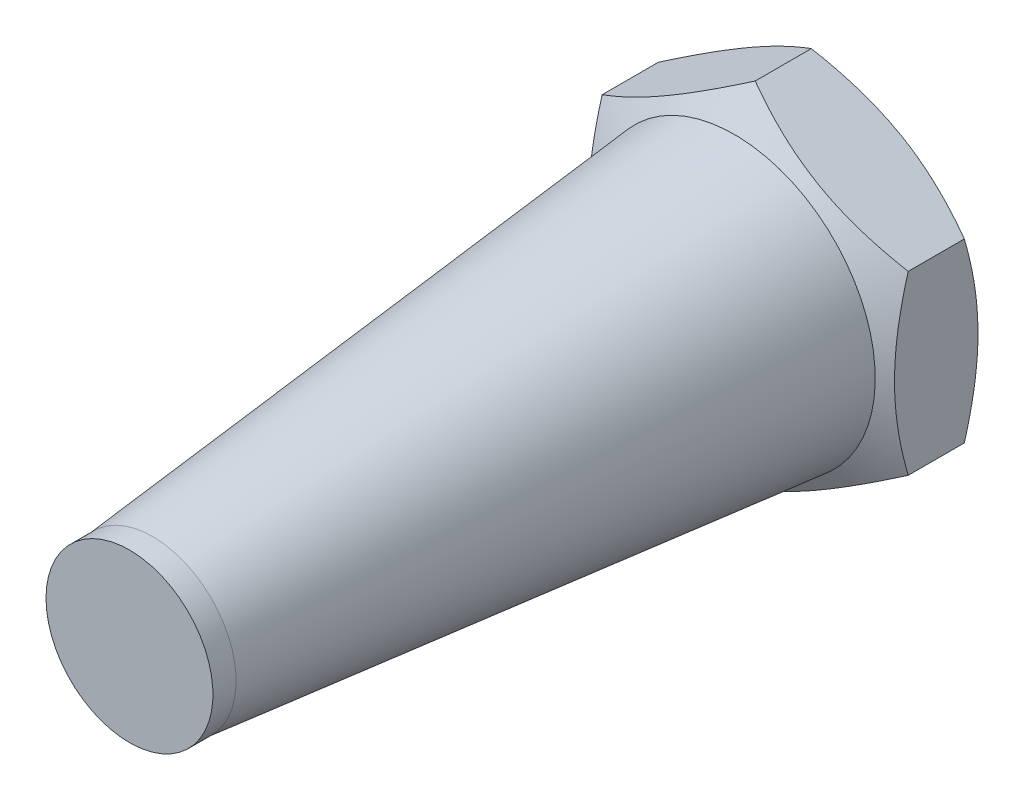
ISO-10303-21;
HEADER;
FILE_DESCRIPTION(('STEP AP214'),'2;1');
FILE_NAME('part.step','',(''),(''),'','','');
FILE_SCHEMA(('AUTOMOTIVE_DESIGN { 1 0 10303 214 1 1 1 1 }'));
ENDSEC;
DATA;
#1=APPLICATION_CONTEXT('core data for automotive mechanical design processes');
#2=APPLICATION_PROTOCOL_DEFINITION('international standard','automotive_design',2000,#1);
#3=PRODUCT_CONTEXT('',#1,'mechanical');
#4=PRODUCT('Part','Part','',(#3));
#5=PRODUCT_RELATED_PRODUCT_CATEGORY('part','',(#4));
#6=PRODUCT_DEFINITION_FORMATION('','',#4);
#7=PRODUCT_DEFINITION_CONTEXT('part definition',#1,'design');
#8=PRODUCT_DEFINITION('design','',#6,#7);
#9=PRODUCT_DEFINITION_SHAPE('','',#8);
#10=(LENGTH_UNIT() NAMED_UNIT(*) SI_UNIT(.MILLI.,.METRE.));
#11=(NAMED_UNIT(*) PLANE_ANGLE_UNIT() SI_UNIT($,.RADIAN.));
#12=(NAMED_UNIT(*) SI_UNIT($,.STERADIAN.) SOLID_ANGLE_UNIT());
#13=UNCERTAINTY_MEASURE_WITH_UNIT(LENGTH_MEASURE(1.E-05),#10,'distance_accuracy_value','');
#14=(GEOMETRIC_REPRESENTATION_CONTEXT(3) GLOBAL_UNCERTAINTY_ASSIGNED_CONTEXT((#13)) GLOBAL_UNIT_ASSIGNED_CONTEXT((#10,
#11,#12)) REPRESENTATION_CONTEXT('',''));
#15=CARTESIAN_POINT('',(0.,0.,0.));
#16=DIRECTION('',(0.,0.,1.));
#17=DIRECTION('',(1.,0.,0.));
#18=AXIS2_PLACEMENT_3D('',#15,#16,#17);
#19=CARTESIAN_POINT('',(0.,0.,1.5));
#20=DIRECTION('',(0.,0.,-1.));
#21=DIRECTION('',(0.500000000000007,0.866025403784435,0.));
#22=AXIS2_PLACEMENT_3D('',#19,#20,#21);
#23=CONICAL_SURFACE('',#22,8.0980762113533,1.0471975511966);
#24=CARTESIAN_POINT('',(0.,0.,3.2540341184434));
#25=DIRECTION('',(0.,0.,-1.));
#26=DIRECTION('',(0.500000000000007,0.866025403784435,0.));
#27=AXIS2_PLACEMENT_3D('',#24,#25,#26);
#28=CIRCLE('',#27,5.06);
#29=CARTESIAN_POINT('',(2.53000000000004,4.38208854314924,3.2540341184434));
#30=VERTEX_POINT('',#29);
#31=EDGE_CURVE('E280',#30,#30,#28,.T.);
#32=ORIENTED_EDGE('',*,*,#31,.T.);
#33=EDGE_LOOP('',(#32));
#34=FACE_BOUND('',#33,.T.);
#35=CARTESIAN_POINT('',(-4.63445341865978,9.02655588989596,0.317188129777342));
#36=CARTESIAN_POINT('',(-4.42642850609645,8.90645265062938,0.433698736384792));
#37=CARTESIAN_POINT('',(-4.21792578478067,8.78607354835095,0.549091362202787));
#38=CARTESIAN_POINT('',(-3.79971060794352,8.54461690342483,0.777011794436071));
#39=CARTESIAN_POINT('',(-3.58999796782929,8.42353925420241,0.889539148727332));
#40=CARTESIAN_POINT('',(-3.16802728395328,8.17991436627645,1.11166683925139));
#41=CARTESIAN_POINT('',(-2.95576159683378,8.05736271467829,1.22124788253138));
#42=CARTESIAN_POINT('',(-2.52954101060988,7.81128414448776,1.43592160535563));
#43=CARTESIAN_POINT('',(-2.31558619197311,7.6877572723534,1.54101449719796));
#44=CARTESIAN_POINT('',(-1.87876523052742,7.43555857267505,1.74880037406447));
#45=CARTESIAN_POINT('',(-1.6558329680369,7.3068485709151,1.85130903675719));
#46=CARTESIAN_POINT('',(-1.20735940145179,7.04792223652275,2.04856142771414));
#47=CARTESIAN_POINT('',(-0.981817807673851,6.9177057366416,2.14330428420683));
#48=CARTESIAN_POINT('',(-0.528189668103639,6.65580340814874,2.32253603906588));
#49=CARTESIAN_POINT('',(-0.300109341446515,6.52412117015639,2.40704571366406));
#50=CARTESIAN_POINT('',(0.159322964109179,6.25886780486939,2.56309752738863));
#51=CARTESIAN_POINT('',(0.390673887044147,6.12529728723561,2.63464375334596));
#52=CARTESIAN_POINT('',(0.855502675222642,5.85692826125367,2.76095502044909));
#53=CARTESIAN_POINT('',(1.08896178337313,5.72214058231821,2.81581040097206));
#54=CARTESIAN_POINT('',(1.55878077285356,5.45089046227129,2.90563425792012));
#55=CARTESIAN_POINT('',(1.79514037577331,5.31442818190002,2.94060462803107));
#56=CARTESIAN_POINT('',(2.26649270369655,5.04229278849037,2.98741101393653));
#57=CARTESIAN_POINT('',(2.50146273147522,4.90663277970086,2.99954428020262));
#58=CARTESIAN_POINT('',(2.97145539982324,4.63528238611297,3.00043005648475));
#59=CARTESIAN_POINT('',(3.20647804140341,4.49959200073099,2.9891820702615));
#60=CARTESIAN_POINT('',(3.60553078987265,4.26919878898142,2.95102792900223));
#61=CARTESIAN_POINT('',(3.76998818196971,4.17424926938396,2.92974037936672));
#62=CARTESIAN_POINT('',(4.09769047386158,3.98505026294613,2.87704309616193));
#63=CARTESIAN_POINT('',(4.26093520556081,3.89080087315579,2.84563198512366));
#64=CARTESIAN_POINT('',(4.74863690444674,3.60922616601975,2.73786529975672));
#65=CARTESIAN_POINT('',(5.07087880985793,3.42317971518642,2.64799613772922));
#66=CARTESIAN_POINT('',(5.55274402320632,3.1449747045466,2.49227965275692));
#67=CARTESIAN_POINT('',(5.71486728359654,3.05137279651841,2.43616090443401));
#68=CARTESIAN_POINT('',(6.03753849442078,2.86507848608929,2.31812622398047));
#69=CARTESIAN_POINT('',(6.19808643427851,2.77238608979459,2.25621025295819));
#70=CARTESIAN_POINT('',(6.51765874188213,2.58788093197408,2.12757219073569));
#71=CARTESIAN_POINT('',(6.67668359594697,2.49606788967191,2.06085169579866));
#72=CARTESIAN_POINT('',(6.99341719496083,2.31320166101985,1.92338647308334));
#73=CARTESIAN_POINT('',(7.15112595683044,2.22214846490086,1.85264179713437));
#74=CARTESIAN_POINT('',(7.52950150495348,2.00369324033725,1.67824012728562));
#75=CARTESIAN_POINT('',(7.74959700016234,1.87662104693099,1.57293336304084));
#76=CARTESIAN_POINT('',(8.18787356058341,1.62358195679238,1.35712011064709));
#77=CARTESIAN_POINT('',(8.40605449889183,1.49761513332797,1.24661328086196));
#78=CARTESIAN_POINT('',(8.84086446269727,1.24657748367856,1.02146878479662));
#79=CARTESIAN_POINT('',(9.05749314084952,1.12150685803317,0.906830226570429));
#80=CARTESIAN_POINT('',(9.48942656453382,0.87212997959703,0.674268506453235));
#81=CARTESIAN_POINT('',(9.70473128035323,0.747823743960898,0.556345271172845));
#82=CARTESIAN_POINT('',(10.1344754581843,0.499710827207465,0.317712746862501));
#83=CARTESIAN_POINT('',(10.3489136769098,0.375904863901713,0.197000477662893));
#84=CARTESIAN_POINT('',(10.7768618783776,0.128828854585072,-0.0466003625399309));
#85=CARTESIAN_POINT('',(10.9903718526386,0.00555881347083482,-0.169488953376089));
#86=CARTESIAN_POINT('',(11.6296754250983,-0.363543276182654,-0.540793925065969));
#87=CARTESIAN_POINT('',(12.0543041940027,-0.608702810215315,-0.791883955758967));
#88=CARTESIAN_POINT('',(12.8646905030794,-1.07657956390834,-1.27711141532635));
#89=CARTESIAN_POINT('',(13.250633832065,-1.29940404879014,-1.51083699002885));
#90=CARTESIAN_POINT('',(14.0211073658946,-1.74423715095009,-1.98141180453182));
#91=CARTESIAN_POINT('',(14.4056375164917,-1.96624573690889,-2.21826116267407));
#92=CARTESIAN_POINT('',(15.1726058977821,-2.40905513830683,-2.69371435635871));
#93=CARTESIAN_POINT('',(15.5550469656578,-2.62985759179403,-2.93231209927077));
#94=CARTESIAN_POINT('',(16.3190296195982,-3.07094318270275,-3.41136076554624));
#95=CARTESIAN_POINT('',(16.7005712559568,-3.29122634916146,-3.65181158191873));
#96=CARTESIAN_POINT('',(17.0817838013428,-3.51131951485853,-3.89295145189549));
#97=B_SPLINE_CURVE_WITH_KNOTS('',3,(#35,#36,#37,#38,#39,#40,#41,#42,#43,#44,#45,#46,#47,#48,#49,
#50,#51,#52,#53,#54,#55,#56,#57,#58,#59,#60,#61,#62,#63,#64,#65,#66,#67,#68,#69,#70,#71,#72,#73,
#74,#75,#76,#77,#78,#79,#80,#81,#82,#83,#84,#85,#86,#87,#88,#89,#90,#91,#92,#93,#94,#95,#96),
.UNSPECIFIED.,.F.,.F.,(4,2,2,2,2,2,2,2,2,2,2,2,2,2,2,2,2,2,2,2,2,2,2,2,2,2,2,2,2,2,4),(0.,
0.800924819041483,1.60197524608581,2.40739108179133,3.21276877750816,4.04391063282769,
4.87514566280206,5.70466370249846,6.53391977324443,7.35860419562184,8.18321006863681,
8.99700649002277,9.81082018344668,10.3838076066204,10.9568730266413,12.1036361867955,
12.6898898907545,13.2761475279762,13.8622112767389,14.4482674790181,15.2734821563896,
16.0987511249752,16.924199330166,17.7496659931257,18.5760597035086,19.4024609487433,
21.0550266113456,22.5646743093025,24.0743793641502,25.5801946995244,27.0859237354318),.UNSPECIFIED.);
#98=CARTESIAN_POINT('',(5.5,3.17542648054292,2.50875981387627));
#99=VERTEX_POINT('',#98);
#100=CARTESIAN_POINT('',(0.,6.35085296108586,2.50875981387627));
#101=VERTEX_POINT('',#100);
#102=EDGE_CURVE('E102',#99,#101,#97,.F.);
#103=ORIENTED_EDGE('',*,*,#102,.T.);
#104=CARTESIAN_POINT('',(0.000200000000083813,6.3509684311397,2.50869314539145));
#105=CARTESIAN_POINT('',(-0.12069657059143,6.28116876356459,2.54898642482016));
#106=CARTESIAN_POINT('',(-0.242043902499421,6.21110884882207,2.58745108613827));
#107=CARTESIAN_POINT('',(-0.485724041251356,6.07042005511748,2.6602195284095));
#108=CARTESIAN_POINT('',(-0.608057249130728,5.99979094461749,2.6945215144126));
#109=CARTESIAN_POINT('',(-0.977015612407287,5.78677273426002,2.79051018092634));
#110=CARTESIAN_POINT('',(-1.22509718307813,5.64354277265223,2.84510769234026));
#111=CARTESIAN_POINT('',(-1.59634674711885,5.42920173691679,2.90913016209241));
#112=CARTESIAN_POINT('',(-1.71840546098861,5.35873110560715,2.92736840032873));
#113=CARTESIAN_POINT('',(-1.96307442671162,5.21747141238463,2.95795148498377));
#114=CARTESIAN_POINT('',(-2.08568462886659,5.14668237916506,2.97029685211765));
#115=CARTESIAN_POINT('',(-2.33111799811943,5.00498135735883,2.98877956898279));
#116=CARTESIAN_POINT('',(-2.45394076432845,4.93406960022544,2.99492396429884));
#117=CARTESIAN_POINT('',(-2.69969299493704,4.79218448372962,3.00087957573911));
#118=CARTESIAN_POINT('',(-2.82262245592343,4.7212111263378,3.00069098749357));
#119=CARTESIAN_POINT('',(-3.159414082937,4.52676438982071,2.99146908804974));
#120=CARTESIAN_POINT('',(-3.37316601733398,4.40335465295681,2.97598603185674));
#121=CARTESIAN_POINT('',(-3.79925015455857,4.15735486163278,2.92688789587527));
#122=CARTESIAN_POINT('',(-4.01158085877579,4.03476567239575,2.89325603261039));
#123=CARTESIAN_POINT('',(-4.43852257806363,3.78827075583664,2.80918564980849));
#124=CARTESIAN_POINT('',(-4.65307971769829,3.66439613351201,2.75839091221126));
#125=CARTESIAN_POINT('',(-5.0789942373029,3.41849427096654,2.64310716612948));
#126=CARTESIAN_POINT('',(-5.29035707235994,3.29646388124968,2.57864523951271));
#127=CARTESIAN_POINT('',(-5.5002,3.17531101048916,2.50869314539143));
#128=B_SPLINE_CURVE_WITH_KNOTS('',3,(#104,#105,#106,#107,#108,#109,#110,#111,#112,#113,#114,
#115,#116,#117,#118,#119,#120,#121,#122,#123,#124,#125,#126,#127),.UNSPECIFIED.,.F.,.F.,(4,2,2,
2,2,2,2,2,2,2,2,4),(0.,0.435859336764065,0.871905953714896,1.74581116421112,2.17206086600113,
2.59827289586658,3.02400011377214,3.44971418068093,4.19085033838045,4.93267305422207,
5.6909489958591,6.44773620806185),.UNSPECIFIED.);
#129=CARTESIAN_POINT('',(-5.5,3.175426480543,2.50875981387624));
#130=VERTEX_POINT('',#129);
#131=EDGE_CURVE('E93',#101,#130,#128,.T.);
#132=ORIENTED_EDGE('',*,*,#131,.T.);
#133=CARTESIAN_POINT('',(-5.5,3.17565742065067,2.50869314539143));
#134=CARTESIAN_POINT('',(-5.5,3.03605808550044,2.54898642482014));
#135=CARTESIAN_POINT('',(-5.5,2.8959382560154,2.58745108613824));
#136=CARTESIAN_POINT('',(-5.5,2.61456066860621,2.66021952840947));
#137=CARTESIAN_POINT('',(-5.5,2.47330244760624,2.69452151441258));
#138=CARTESIAN_POINT('',(-5.5,2.04726602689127,2.79051018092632));
#139=CARTESIAN_POINT('',(-5.5,1.76080610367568,2.84510769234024));
#140=CARTESIAN_POINT('',(-5.5,1.3321240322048,2.90913016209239));
#141=CARTESIAN_POINT('',(-5.5,1.19118276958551,2.92736840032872));
#142=CARTESIAN_POINT('',(-5.5,0.908663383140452,2.95795148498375));
#143=CARTESIAN_POINT('',(-5.5,0.767085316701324,2.97029685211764));
#144=CARTESIAN_POINT('',(-5.5,0.483683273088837,2.98877956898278));
#145=CARTESIAN_POINT('',(-5.5,0.341859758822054,2.99492396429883));
#146=CARTESIAN_POINT('',(-5.5,0.0580895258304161,3.0008795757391));
#147=CARTESIAN_POINT('',(-5.5,-0.083857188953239,3.00069098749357));
#148=CARTESIAN_POINT('',(-5.5,-0.472750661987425,2.99146908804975));
#149=CARTESIAN_POINT('',(-5.5,-0.719570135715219,2.97598603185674));
#150=CARTESIAN_POINT('',(-5.5,-1.21156971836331,2.92688789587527));
#151=CARTESIAN_POINT('',(-5.5,-1.45674809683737,2.8932560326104));
#152=CARTESIAN_POINT('',(-5.5,-1.9497379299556,2.80918564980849));
#153=CARTESIAN_POINT('',(-5.5,-2.19748717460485,2.75839091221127));
#154=CARTESIAN_POINT('',(-5.5,-2.68929089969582,2.6431071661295));
#155=CARTESIAN_POINT('',(-5.5,-2.93335167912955,2.57864523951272));
#156=CARTESIAN_POINT('',(-5.5,-3.1756574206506,2.50869314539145));
#157=B_SPLINE_CURVE_WITH_KNOTS('',3,(#133,#134,#135,#136,#137,#138,#139,#140,#141,#142,#143,
#144,#145,#146,#147,#148,#149,#150,#151,#152,#153,#154,#155,#156),.UNSPECIFIED.,.F.,.F.,(4,2,2,
2,2,2,2,2,2,2,2,4),(0.,0.435859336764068,0.871905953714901,1.74581116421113,2.17206086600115,
2.5982728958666,3.02400011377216,3.44971418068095,4.19085033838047,4.93267305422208,
5.69094899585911,6.44773620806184),.UNSPECIFIED.);
#158=CARTESIAN_POINT('',(-5.5,-3.17542648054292,2.50875981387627));
#159=VERTEX_POINT('',#158);
#160=EDGE_CURVE('E82',#130,#159,#157,.T.);
#161=ORIENTED_EDGE('',*,*,#160,.T.);
#162=CARTESIAN_POINT('',(-10.1344534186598,-0.499723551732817,0.317188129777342));
#163=CARTESIAN_POINT('',(-9.92642850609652,-0.61982679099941,0.433698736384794));
#164=CARTESIAN_POINT('',(-9.71792578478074,-0.74020589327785,0.54909136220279));
#165=CARTESIAN_POINT('',(-9.2997106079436,-0.981662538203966,0.777011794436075));
#166=CARTESIAN_POINT('',(-9.08999796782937,-1.10274018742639,0.889539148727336));
#167=CARTESIAN_POINT('',(-8.66802728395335,-1.34636507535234,1.11166683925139));
#168=CARTESIAN_POINT('',(-8.45576159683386,-1.4689167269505,1.22124788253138));
#169=CARTESIAN_POINT('',(-8.02954101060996,-1.71499529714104,1.43592160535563));
#170=CARTESIAN_POINT('',(-7.81558619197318,-1.8385221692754,1.54101449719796));
#171=CARTESIAN_POINT('',(-7.37876523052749,-2.09072086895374,1.74880037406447));
#172=CARTESIAN_POINT('',(-7.15583296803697,-2.2194308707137,1.85130903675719));
#173=CARTESIAN_POINT('',(-6.70735940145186,-2.47835720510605,2.04856142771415));
#174=CARTESIAN_POINT('',(-6.48181780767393,-2.6085737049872,2.14330428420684));
#175=CARTESIAN_POINT('',(-6.02818966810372,-2.87047603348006,2.32253603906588));
#176=CARTESIAN_POINT('',(-5.80010934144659,-3.00215827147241,2.40704571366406));
#177=CARTESIAN_POINT('',(-5.3406770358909,-3.2674116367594,2.56309752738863));
#178=CARTESIAN_POINT('',(-5.10932611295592,-3.40098215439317,2.63464375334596));
#179=CARTESIAN_POINT('',(-4.64449732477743,-3.66935118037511,2.76095502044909));
#180=CARTESIAN_POINT('',(-4.41103821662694,-3.80413885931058,2.81581040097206));
#181=CARTESIAN_POINT('',(-3.94121922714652,-4.07538897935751,2.90563425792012));
#182=CARTESIAN_POINT('',(-3.70485962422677,-4.21185125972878,2.94060462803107));
#183=CARTESIAN_POINT('',(-3.23350729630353,-4.48398665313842,2.98741101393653));
#184=CARTESIAN_POINT('',(-2.99853726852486,-4.61964666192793,2.99954428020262));
#185=CARTESIAN_POINT('',(-2.52854460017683,-4.89099705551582,3.00043005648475));
#186=CARTESIAN_POINT('',(-2.29352195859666,-5.02668744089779,2.9891820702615));
#187=CARTESIAN_POINT('',(-1.89446921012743,-5.25708065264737,2.95102792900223));
#188=CARTESIAN_POINT('',(-1.73001181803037,-5.35203017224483,2.92974037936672));
#189=CARTESIAN_POINT('',(-1.40230952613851,-5.54122917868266,2.87704309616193));
#190=CARTESIAN_POINT('',(-1.23906479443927,-5.635478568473,2.84563198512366));
#191=CARTESIAN_POINT('',(-0.751363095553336,-5.91705327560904,2.73786529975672));
#192=CARTESIAN_POINT('',(-0.429121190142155,-6.10309972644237,2.64799613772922));
#193=CARTESIAN_POINT('',(0.0527440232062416,-6.38130473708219,2.49227965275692));
#194=CARTESIAN_POINT('',(0.214867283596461,-6.47490664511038,2.43616090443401));
#195=CARTESIAN_POINT('',(0.537538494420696,-6.6612009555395,2.31812622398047));
#196=CARTESIAN_POINT('',(0.698086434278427,-6.7538933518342,2.25621025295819));
#197=CARTESIAN_POINT('',(1.01765874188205,-6.93839850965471,2.12757219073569));
#198=CARTESIAN_POINT('',(1.17668359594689,-7.03021155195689,2.06085169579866));
#199=CARTESIAN_POINT('',(1.49341719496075,-7.21307778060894,1.92338647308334));
#200=CARTESIAN_POINT('',(1.65112595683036,-7.30413097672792,1.85264179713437));
#201=CARTESIAN_POINT('',(2.0295015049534,-7.52258620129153,1.67824012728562));
#202=CARTESIAN_POINT('',(2.24959700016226,-7.64965839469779,1.57293336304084));
#203=CARTESIAN_POINT('',(2.68787356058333,-7.90269748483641,1.35712011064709));
#204=CARTESIAN_POINT('',(2.90605449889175,-8.02866430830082,1.24661328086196));
#205=CARTESIAN_POINT('',(3.34086446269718,-8.27970195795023,1.02146878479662));
#206=CARTESIAN_POINT('',(3.55749314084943,-8.40477258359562,0.906830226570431));
#207=CARTESIAN_POINT('',(3.98942656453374,-8.65414946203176,0.674268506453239));
#208=CARTESIAN_POINT('',(4.20473128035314,-8.77845569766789,0.556345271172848));
#209=CARTESIAN_POINT('',(4.63447545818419,-9.02656861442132,0.317712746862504));
#210=CARTESIAN_POINT('',(4.84891367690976,-9.15037457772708,0.197000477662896));
#211=CARTESIAN_POINT('',(5.27686187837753,-9.39745058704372,-0.0466003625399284));
#212=CARTESIAN_POINT('',(5.49037185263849,-9.52072062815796,-0.169488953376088));
#213=CARTESIAN_POINT('',(6.12967542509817,-9.88982271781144,-0.540793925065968));
#214=CARTESIAN_POINT('',(6.55430419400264,-10.1349822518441,-0.791883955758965));
#215=CARTESIAN_POINT('',(7.36469050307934,-10.6028590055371,-1.27711141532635));
#216=CARTESIAN_POINT('',(7.75063383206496,-10.8256834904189,-1.51083699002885));
#217=CARTESIAN_POINT('',(8.52110736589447,-11.2705165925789,-1.98141180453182));
#218=CARTESIAN_POINT('',(8.90563751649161,-11.4925251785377,-2.21826116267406));
#219=CARTESIAN_POINT('',(9.672605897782,-11.9353345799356,-2.6937143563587));
#220=CARTESIAN_POINT('',(10.0550469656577,-12.1561370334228,-2.93231209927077));
#221=CARTESIAN_POINT('',(10.8190296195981,-12.5972226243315,-3.41136076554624));
#222=CARTESIAN_POINT('',(11.2005712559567,-12.8175057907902,-3.65181158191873));
#223=CARTESIAN_POINT('',(11.5817838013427,-13.0375989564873,-3.89295145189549));
#224=B_SPLINE_CURVE_WITH_KNOTS('',3,(#162,#163,#164,#165,#166,#167,#168,#169,#170,#171,#172,
#173,#174,#175,#176,#177,#178,#179,#180,#181,#182,#183,#184,#185,#186,#187,#188,#189,#190,#191,
#192,#193,#194,#195,#196,#197,#198,#199,#200,#201,#202,#203,#204,#205,#206,#207,#208,#209,#210,
#211,#212,#213,#214,#215,#216,#217,#218,#219,#220,#221,#222,#223),.UNSPECIFIED.,.F.,.F.,(4,2,2,
2,2,2,2,2,2,2,2,2,2,2,2,2,2,2,2,2,2,2,2,2,2,2,2,2,2,2,4),(0.,0.80092481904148,1.6019752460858,
2.40739108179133,3.21276877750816,4.04391063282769,4.87514566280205,5.70466370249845,
6.53391977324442,7.35860419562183,8.1832100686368,8.99700649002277,9.81082018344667,
10.3838076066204,10.9568730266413,12.1036361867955,12.6898898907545,13.2761475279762,
13.8622112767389,14.4482674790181,15.2734821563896,16.0987511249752,16.924199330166,
17.7496659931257,18.5760597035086,19.4024609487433,21.0550266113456,22.5646743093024,
24.0743793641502,25.5801946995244,27.0859237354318),.UNSPECIFIED.);
#225=CARTESIAN_POINT('',(0.,-6.35085296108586,2.50875981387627));
#226=VERTEX_POINT('',#225);
#227=EDGE_CURVE('E229',#159,#226,#224,.T.);
#228=ORIENTED_EDGE('',*,*,#227,.T.);
#229=CARTESIAN_POINT('',(-0.000200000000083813,-6.3509684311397,2.50869314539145));
#230=CARTESIAN_POINT('',(0.12069657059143,-6.28116876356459,2.54898642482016));
#231=CARTESIAN_POINT('',(0.242043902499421,-6.21110884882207,2.58745108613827));
#232=CARTESIAN_POINT('',(0.485724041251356,-6.07042005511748,2.6602195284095));
#233=CARTESIAN_POINT('',(0.608057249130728,-5.99979094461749,2.6945215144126));
#234=CARTESIAN_POINT('',(0.977015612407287,-5.78677273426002,2.79051018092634));
#235=CARTESIAN_POINT('',(1.22509718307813,-5.64354277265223,2.84510769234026));
#236=CARTESIAN_POINT('',(1.59634674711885,-5.42920173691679,2.90913016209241));
#237=CARTESIAN_POINT('',(1.71840546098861,-5.35873110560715,2.92736840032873));
#238=CARTESIAN_POINT('',(1.96307442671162,-5.21747141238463,2.95795148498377));
#239=CARTESIAN_POINT('',(2.08568462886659,-5.14668237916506,2.97029685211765));
#240=CARTESIAN_POINT('',(2.33111799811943,-5.00498135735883,2.98877956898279));
#241=CARTESIAN_POINT('',(2.45394076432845,-4.93406960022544,2.99492396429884));
#242=CARTESIAN_POINT('',(2.69969299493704,-4.79218448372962,3.00087957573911));
#243=CARTESIAN_POINT('',(2.82262245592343,-4.7212111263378,3.00069098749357));
#244=CARTESIAN_POINT('',(3.159414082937,-4.52676438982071,2.99146908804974));
#245=CARTESIAN_POINT('',(3.37316601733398,-4.40335465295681,2.97598603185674));
#246=CARTESIAN_POINT('',(3.79925015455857,-4.15735486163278,2.92688789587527));
#247=CARTESIAN_POINT('',(4.01158085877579,-4.03476567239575,2.89325603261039));
#248=CARTESIAN_POINT('',(4.43852257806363,-3.78827075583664,2.80918564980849));
#249=CARTESIAN_POINT('',(4.65307971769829,-3.66439613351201,2.75839091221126));
#250=CARTESIAN_POINT('',(5.0789942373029,-3.41849427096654,2.64310716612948));
#251=CARTESIAN_POINT('',(5.29035707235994,-3.29646388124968,2.57864523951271));
#252=CARTESIAN_POINT('',(5.5002,-3.17531101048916,2.50869314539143));
#253=B_SPLINE_CURVE_WITH_KNOTS('',3,(#229,#230,#231,#232,#233,#234,#235,#236,#237,#238,#239,
#240,#241,#242,#243,#244,#245,#246,#247,#248,#249,#250,#251,#252),.UNSPECIFIED.,.F.,.F.,(4,2,2,
2,2,2,2,2,2,2,2,4),(0.,0.435859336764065,0.871905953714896,1.74581116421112,2.17206086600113,
2.59827289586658,3.02400011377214,3.44971418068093,4.19085033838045,4.93267305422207,
5.6909489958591,6.44773620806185),.UNSPECIFIED.);
#254=CARTESIAN_POINT('',(5.5,-3.175426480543,2.50875981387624));
#255=VERTEX_POINT('',#254);
#256=EDGE_CURVE('E215',#226,#255,#253,.T.);
#257=ORIENTED_EDGE('',*,*,#256,.T.);
#258=CARTESIAN_POINT('',(5.5,-3.17565742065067,2.50869314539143));
#259=CARTESIAN_POINT('',(5.5,-3.03605808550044,2.54898642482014));
#260=CARTESIAN_POINT('',(5.5,-2.8959382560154,2.58745108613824));
#261=CARTESIAN_POINT('',(5.5,-2.61456066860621,2.66021952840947));
#262=CARTESIAN_POINT('',(5.5,-2.47330244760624,2.69452151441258));
#263=CARTESIAN_POINT('',(5.5,-2.04726602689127,2.79051018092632));
#264=CARTESIAN_POINT('',(5.5,-1.76080610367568,2.84510769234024));
#265=CARTESIAN_POINT('',(5.5,-1.3321240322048,2.90913016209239));
#266=CARTESIAN_POINT('',(5.5,-1.19118276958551,2.92736840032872));
#267=CARTESIAN_POINT('',(5.5,-0.908663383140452,2.95795148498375));
#268=CARTESIAN_POINT('',(5.5,-0.767085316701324,2.97029685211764));
#269=CARTESIAN_POINT('',(5.5,-0.483683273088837,2.98877956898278));
#270=CARTESIAN_POINT('',(5.5,-0.341859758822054,2.99492396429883));
#271=CARTESIAN_POINT('',(5.5,-0.0580895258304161,3.0008795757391));
#272=CARTESIAN_POINT('',(5.5,0.083857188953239,3.00069098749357));
#273=CARTESIAN_POINT('',(5.5,0.472750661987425,2.99146908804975));
#274=CARTESIAN_POINT('',(5.5,0.719570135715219,2.97598603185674));
#275=CARTESIAN_POINT('',(5.5,1.21156971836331,2.92688789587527));
#276=CARTESIAN_POINT('',(5.5,1.45674809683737,2.8932560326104));
#277=CARTESIAN_POINT('',(5.5,1.9497379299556,2.80918564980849));
#278=CARTESIAN_POINT('',(5.5,2.19748717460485,2.75839091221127));
#279=CARTESIAN_POINT('',(5.5,2.68929089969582,2.6431071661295));
#280=CARTESIAN_POINT('',(5.5,2.93335167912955,2.57864523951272));
#281=CARTESIAN_POINT('',(5.5,3.1756574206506,2.50869314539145));
#282=B_SPLINE_CURVE_WITH_KNOTS('',3,(#258,#259,#260,#261,#262,#263,#264,#265,#266,#267,#268,
#269,#270,#271,#272,#273,#274,#275,#276,#277,#278,#279,#280,#281),.UNSPECIFIED.,.F.,.F.,(4,2,2,
2,2,2,2,2,2,2,2,4),(0.,0.435859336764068,0.871905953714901,1.74581116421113,2.17206086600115,
2.5982728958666,3.02400011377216,3.44971418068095,4.19085033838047,4.93267305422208,
5.69094899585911,6.44773620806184),.UNSPECIFIED.);
#283=EDGE_CURVE('E188',#255,#99,#282,.T.);
#284=ORIENTED_EDGE('',*,*,#283,.T.);
#285=EDGE_LOOP('',(#103,#132,#161,#228,#257,#284));
#286=FACE_BOUND('',#285,.T.);
#287=ADVANCED_FACE('F14',(#34,#286),#23,.T.);
#288=CARTESIAN_POINT('',(0.,0.,25.));
#289=DIRECTION('',(0.,0.,1.));
#290=DIRECTION('',(-0.500000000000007,-0.866025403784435,0.));
#291=AXIS2_PLACEMENT_3D('',#288,#289,#290);
#292=PLANE('',#291);
#293=CARTESIAN_POINT('',(0.,0.,25.));
#294=DIRECTION('',(0.,0.,-1.));
#295=DIRECTION('',(0.500000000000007,0.866025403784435,0.));
#296=AXIS2_PLACEMENT_3D('',#293,#294,#295);
#297=CIRCLE('',#296,3.);
#298=CARTESIAN_POINT('',(1.50000000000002,2.5980762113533,25.));
#299=VERTEX_POINT('',#298);
#300=EDGE_CURVE('E9',#299,#299,#297,.T.);
#301=ORIENTED_EDGE('',*,*,#300,.F.);
#302=EDGE_LOOP('',(#301));
#303=FACE_BOUND('',#302,.T.);
#304=ADVANCED_FACE('F16',(#303),#292,.T.);
#305=CARTESIAN_POINT('',(0.,0.,11.9085));
#306=DIRECTION('',(0.,0.,-1.));
#307=DIRECTION('',(0.500000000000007,0.866025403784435,0.));
#308=AXIS2_PLACEMENT_3D('',#305,#306,#307);
#309=CYLINDRICAL_SURFACE('',#308,3.);
#310=ORIENTED_EDGE('',*,*,#300,.T.);
#311=EDGE_LOOP('',(#310));
#312=FACE_BOUND('',#311,.T.);
#313=CARTESIAN_POINT('',(0.,0.,24.166666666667));
#314=DIRECTION('',(0.,0.,-1.));
#315=DIRECTION('',(0.500000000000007,0.866025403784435,0.));
#316=AXIS2_PLACEMENT_3D('',#313,#314,#315);
#317=CIRCLE('',#316,3.);
#318=CARTESIAN_POINT('',(1.50000000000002,2.5980762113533,24.166666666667));
#319=VERTEX_POINT('',#318);
#320=EDGE_CURVE('E22',#319,#319,#317,.T.);
#321=ORIENTED_EDGE('',*,*,#320,.F.);
#322=EDGE_LOOP('',(#321));
#323=FACE_BOUND('',#322,.T.);
#324=ADVANCED_FACE('F301',(#312,#323),#309,.T.);
#325=CARTESIAN_POINT('',(0.,0.,3.2540341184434));
#326=DIRECTION('',(0.,0.,-1.));
#327=DIRECTION('',(0.500000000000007,0.866025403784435,0.));
#328=AXIS2_PLACEMENT_3D('',#325,#326,#327);
#329=CONICAL_SURFACE('',#328,5.06,0.0981882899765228);
#330=ORIENTED_EDGE('',*,*,#320,.T.);
#331=EDGE_LOOP('',(#330));
#332=FACE_BOUND('',#331,.T.);
#333=ORIENTED_EDGE('',*,*,#31,.F.);
#334=EDGE_LOOP('',(#333));
#335=FACE_BOUND('',#334,.T.);
#336=ADVANCED_FACE('F131',(#332,#335),#329,.T.);
#337=CARTESIAN_POINT('',(0.,6.35085296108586,-25.));
#338=DIRECTION('',(-0.499999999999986,0.866025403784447,0.));
#339=DIRECTION('',(-0.866025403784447,-0.499999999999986,0.));
#340=AXIS2_PLACEMENT_3D('',#337,#338,#339);
#341=PLANE('',#340);
#342=DIRECTION('',(0.,0.,1.));
#343=VECTOR('',#342,1.);
#344=CARTESIAN_POINT('',(0.,6.35085296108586,-25.));
#345=LINE('',#344,#343);
#346=CARTESIAN_POINT('',(0.,6.35085296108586,0.491240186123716));
#347=VERTEX_POINT('',#346);
#348=EDGE_CURVE('E258',#347,#101,#345,.T.);
#349=ORIENTED_EDGE('',*,*,#348,.F.);
#350=CARTESIAN_POINT('',(-5.5002,3.17531101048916,0.491306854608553));
#351=CARTESIAN_POINT('',(-5.37930342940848,3.24511067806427,0.451013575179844));
#352=CARTESIAN_POINT('',(-5.25795609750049,3.31517059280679,0.41254891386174));
#353=CARTESIAN_POINT('',(-5.01427595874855,3.45585938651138,0.339780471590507));
#354=CARTESIAN_POINT('',(-4.89194275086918,3.52648849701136,0.305478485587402));
#355=CARTESIAN_POINT('',(-4.52298438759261,3.73950670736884,0.20948981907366));
#356=CARTESIAN_POINT('',(-4.27490281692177,3.88273666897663,0.154892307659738));
#357=CARTESIAN_POINT('',(-3.90365325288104,4.09707770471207,0.0908698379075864));
#358=CARTESIAN_POINT('',(-3.78159453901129,4.16754833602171,0.0726315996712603));
#359=CARTESIAN_POINT('',(-3.53692557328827,4.30880802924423,0.0420485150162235));
#360=CARTESIAN_POINT('',(-3.4143153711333,4.3795970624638,0.0297031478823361));
#361=CARTESIAN_POINT('',(-3.16888200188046,4.52129808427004,0.0112204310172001));
#362=CARTESIAN_POINT('',(-3.04605923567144,4.59220984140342,0.00507603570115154));
#363=CARTESIAN_POINT('',(-2.80030700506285,4.73409495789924,-0.000879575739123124));
#364=CARTESIAN_POINT('',(-2.67737754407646,4.80506831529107,-0.000690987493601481));
#365=CARTESIAN_POINT('',(-2.34058591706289,4.99951505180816,0.00853091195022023));
#366=CARTESIAN_POINT('',(-2.12683398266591,5.12292478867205,0.0240139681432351));
#367=CARTESIAN_POINT('',(-1.70074984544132,5.36892457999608,0.0731121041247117));
#368=CARTESIAN_POINT('',(-1.48841914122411,5.49151376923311,0.106743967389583));
#369=CARTESIAN_POINT('',(-1.06147742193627,5.73800868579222,0.190814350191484));
#370=CARTESIAN_POINT('',(-0.846920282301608,5.86188330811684,0.241609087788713));
#371=CARTESIAN_POINT('',(-0.421005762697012,6.10778517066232,0.356892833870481));
#372=CARTESIAN_POINT('',(-0.209642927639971,6.22981556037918,0.421354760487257));
#373=CARTESIAN_POINT('',(0.000200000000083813,6.3509684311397,0.49130685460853));
#374=B_SPLINE_CURVE_WITH_KNOTS('',3,(#350,#351,#352,#353,#354,#355,#356,#357,#358,#359,#360,
#361,#362,#363,#364,#365,#366,#367,#368,#369,#370,#371,#372,#373),.UNSPECIFIED.,.F.,.F.,(4,2,2,
2,2,2,2,2,2,2,2,4),(0.,0.43585933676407,0.871905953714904,1.74581116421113,2.17206086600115,
2.59827289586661,3.02400011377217,3.44971418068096,4.19085033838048,4.93267305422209,
5.69094899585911,6.44773620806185),.UNSPECIFIED.);
#375=CARTESIAN_POINT('',(-2.74999999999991,4.76313972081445,0.));
#376=VERTEX_POINT('',#375);
#377=EDGE_CURVE('E109',#376,#347,#374,.T.);
#378=ORIENTED_EDGE('',*,*,#377,.F.);
#379=CARTESIAN_POINT('',(-5.5,3.175426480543,0.491240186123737));
#380=VERTEX_POINT('',#379);
#381=EDGE_CURVE('E96',#380,#376,#374,.T.);
#382=ORIENTED_EDGE('',*,*,#381,.F.);
#383=DIRECTION('',(0.,0.,1.));
#384=VECTOR('',#383,1.);
#385=CARTESIAN_POINT('',(-5.5,3.175426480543,-25.));
#386=LINE('',#385,#384);
#387=EDGE_CURVE('E35',#380,#130,#386,.T.);
#388=ORIENTED_EDGE('',*,*,#387,.T.);
#389=ORIENTED_EDGE('',*,*,#131,.F.);
#390=EDGE_LOOP('',(#349,#378,#382,#388,#389));
#391=FACE_BOUND('',#390,.T.);
#392=ADVANCED_FACE('F92',(#391),#341,.T.);
#393=CARTESIAN_POINT('',(5.5,3.17542648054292,-25.));
#394=DIRECTION('',(0.500000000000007,0.866025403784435,0.));
#395=DIRECTION('',(-0.866025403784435,0.500000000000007,0.));
#396=AXIS2_PLACEMENT_3D('',#393,#394,#395);
#397=PLANE('',#396);
#398=DIRECTION('',(0.,0.,1.));
#399=VECTOR('',#398,1.);
#400=CARTESIAN_POINT('',(5.5,3.17542648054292,-25.));
#401=LINE('',#400,#399);
#402=CARTESIAN_POINT('',(5.5,3.17542648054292,0.491240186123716));
#403=VERTEX_POINT('',#402);
#404=EDGE_CURVE('E255',#403,#99,#401,.T.);
#405=ORIENTED_EDGE('',*,*,#404,.F.);
#406=CARTESIAN_POINT('',(-4.665275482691,9.04435101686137,2.70008996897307));
#407=CARTESIAN_POINT('',(-4.45700252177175,8.92410456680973,2.58329769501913));
#408=CARTESIAN_POINT('',(-4.24825451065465,8.80358384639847,2.46761578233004));
#409=CARTESIAN_POINT('',(-3.82955588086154,8.56184807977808,2.23909648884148));
#410=CARTESIAN_POINT('',(-3.61960508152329,8.44063292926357,2.12625954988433));
#411=CARTESIAN_POINT('',(-3.19718017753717,8.19674579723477,1.90349331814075));
#412=CARTESIAN_POINT('',(-2.98469857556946,8.07406948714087,1.79358291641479));
#413=CARTESIAN_POINT('',(-2.55805535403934,7.82774690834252,1.57821612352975));
#414=CARTESIAN_POINT('',(-2.34389381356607,7.70410068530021,1.47275952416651));
#415=CARTESIAN_POINT('',(-1.90651825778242,7.45158179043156,1.26412065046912));
#416=CARTESIAN_POINT('',(-1.68323704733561,7.3226703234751,1.16112517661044));
#417=CARTESIAN_POINT('',(-1.23407282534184,7.06334523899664,0.962850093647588));
#418=CARTESIAN_POINT('',(-1.00818952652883,6.93293145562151,0.867571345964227));
#419=CARTESIAN_POINT('',(-0.553875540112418,6.67063315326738,0.68720695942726));
#420=CARTESIAN_POINT('',(-0.325450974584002,6.53875216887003,0.60210096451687));
#421=CARTESIAN_POINT('',(0.134674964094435,6.27309833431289,0.444791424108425));
#422=CARTESIAN_POINT('',(0.36637528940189,6.1393260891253,0.372583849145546));
#423=CARTESIAN_POINT('',(0.831886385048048,5.87056313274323,0.24490271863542));
#424=CARTESIAN_POINT('',(1.06567780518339,5.73558359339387,0.18933682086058));
#425=CARTESIAN_POINT('',(1.53619803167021,5.46392861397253,0.0980537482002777));
#426=CARTESIAN_POINT('',(1.77292655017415,5.32725334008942,0.06233464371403));
#427=CARTESIAN_POINT('',(2.24503491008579,5.05468145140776,0.0140608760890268));
#428=CARTESIAN_POINT('',(2.48039113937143,4.91879846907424,0.00120590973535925));
#429=CARTESIAN_POINT('',(2.95120766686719,4.64697242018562,-0.00104219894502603));
#430=CARTESIAN_POINT('',(3.18666796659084,4.5110293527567,0.0095650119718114));
#431=CARTESIAN_POINT('',(3.58557345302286,4.28072116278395,0.0466564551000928));
#432=CARTESIAN_POINT('',(3.74944198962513,4.18611161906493,0.067426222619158));
#433=CARTESIAN_POINT('',(4.07599088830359,3.99757852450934,0.119054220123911));
#434=CARTESIAN_POINT('',(4.2386710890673,3.90365506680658,0.149913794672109));
#435=CARTESIAN_POINT('',(4.72470686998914,3.62304217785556,0.256006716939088));
#436=CARTESIAN_POINT('',(5.04587836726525,3.43761372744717,0.34473536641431));
#437=CARTESIAN_POINT('',(5.52614162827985,3.16033360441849,0.498757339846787));
#438=CARTESIAN_POINT('',(5.68771938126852,3.06704664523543,0.554305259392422));
#439=CARTESIAN_POINT('',(6.00930564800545,2.88137872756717,0.671212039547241));
#440=CARTESIAN_POINT('',(6.16931415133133,2.78899777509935,0.732570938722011));
#441=CARTESIAN_POINT('',(6.4878117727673,2.60511308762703,0.860111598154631));
#442=CARTESIAN_POINT('',(6.64630136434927,2.51360907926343,0.92629179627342));
#443=CARTESIAN_POINT('',(6.96196516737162,2.33136049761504,1.06269233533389));
#444=CARTESIAN_POINT('',(7.1191393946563,2.24061591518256,1.13291262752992));
#445=CARTESIAN_POINT('',(7.49164400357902,2.02555027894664,1.30396587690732));
#446=CARTESIAN_POINT('',(7.70645001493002,1.90153197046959,1.40631864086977));
#447=CARTESIAN_POINT('',(8.13421533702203,1.65456154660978,1.61606120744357));
#448=CARTESIAN_POINT('',(8.34717452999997,1.53160949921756,1.72345132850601));
#449=CARTESIAN_POINT('',(8.7715877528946,1.2865744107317,1.94225171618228));
#450=CARTESIAN_POINT('',(8.98304145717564,1.1644915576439,2.05366282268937));
#451=CARTESIAN_POINT('',(9.40466020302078,0.92106986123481,2.2796959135));
#452=CARTESIAN_POINT('',(9.61482521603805,0.799731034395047,2.39431796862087));
#453=CARTESIAN_POINT('',(10.0343046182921,0.557544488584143,2.62629189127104));
#454=CARTESIAN_POINT('',(10.2436178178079,0.436697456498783,2.74364662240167));
#455=CARTESIAN_POINT('',(10.6613340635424,0.195528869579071,2.98049832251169));
#456=CARTESIAN_POINT('',(10.8697371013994,0.075207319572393,3.09999531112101));
#457=CARTESIAN_POINT('',(11.4937420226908,-0.285062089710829,3.46109375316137));
#458=CARTESIAN_POINT('',(11.9081979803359,-0.524348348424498,3.70533517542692));
#459=CARTESIAN_POINT('',(12.6998512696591,-0.981409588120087,4.17784413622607));
#460=CARTESIAN_POINT('',(13.077228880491,-1.19928865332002,4.4057107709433));
#461=CARTESIAN_POINT('',(13.8305759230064,-1.63423377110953,4.86456308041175));
#462=CARTESIAN_POINT('',(14.2065453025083,-1.85129979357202,5.09554886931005));
#463=CARTESIAN_POINT('',(14.9564251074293,-2.28424310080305,5.55929876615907));
#464=CARTESIAN_POINT('',(15.3303383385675,-2.50012200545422,5.79205683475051));
#465=CARTESIAN_POINT('',(16.077265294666,-2.93136048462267,6.25943215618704));
#466=CARTESIAN_POINT('',(16.4502790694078,-3.14672008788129,6.49404930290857));
#467=CARTESIAN_POINT('',(16.8229623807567,-3.36188889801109,6.72935957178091));
#468=B_SPLINE_CURVE_WITH_KNOTS('',3,(#406,#407,#408,#409,#410,#411,#412,#413,#414,#415,#416,
#417,#418,#419,#420,#421,#422,#423,#424,#425,#426,#427,#428,#429,#430,#431,#432,#433,#434,#435,
#436,#437,#438,#439,#440,#441,#442,#443,#444,#445,#446,#447,#448,#449,#450,#451,#452,#453,#454,
#455,#456,#457,#458,#459,#460,#461,#462,#463,#464,#465,#466,#467),.UNSPECIFIED.,.F.,.F.,(4,2,2,
2,2,2,2,2,2,2,2,2,2,2,2,2,2,2,2,2,2,2,2,2,2,2,2,2,2,2,4),(0.,0.8020666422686,1.60425709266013,
2.41075980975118,3.21722478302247,4.05003181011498,4.88293167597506,5.71413594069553,
6.54508008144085,7.37132416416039,8.19748790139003,9.01271815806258,9.82796068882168,
10.3987510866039,10.9696175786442,12.1119712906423,12.6959233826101,13.2798793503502,
13.863646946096,14.4474074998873,15.2523068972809,16.0572572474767,16.8623767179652,
17.667513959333,18.4735366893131,19.2795668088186,20.8914029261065,22.3666098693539,
23.84187094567,25.3133687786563,26.7847832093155),.UNSPECIFIED.);
#469=CARTESIAN_POINT('',(2.75000000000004,4.76313972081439,0.));
#470=VERTEX_POINT('',#469);
#471=EDGE_CURVE('E180',#470,#403,#468,.T.);
#472=ORIENTED_EDGE('',*,*,#471,.F.);
#473=EDGE_CURVE('E187',#347,#470,#468,.T.);
#474=ORIENTED_EDGE('',*,*,#473,.F.);
#475=ORIENTED_EDGE('',*,*,#348,.T.);
#476=ORIENTED_EDGE('',*,*,#102,.F.);
#477=EDGE_LOOP('',(#405,#472,#474,#475,#476));
#478=FACE_BOUND('',#477,.T.);
#479=ADVANCED_FACE('F130',(#478),#397,.T.);
#480=CARTESIAN_POINT('',(5.5,-3.175426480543,-25.));
#481=DIRECTION('',(1.,0.,0.));
#482=DIRECTION('',(0.,1.,0.));
#483=AXIS2_PLACEMENT_3D('',#480,#481,#482);
#484=PLANE('',#483);
#485=DIRECTION('',(0.,0.,1.));
#486=VECTOR('',#485,1.);
#487=CARTESIAN_POINT('',(5.5,-3.175426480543,-25.));
#488=LINE('',#487,#486);
#489=CARTESIAN_POINT('',(5.5,-3.175426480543,0.491240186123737));
#490=VERTEX_POINT('',#489);
#491=EDGE_CURVE('E250',#490,#255,#488,.T.);
#492=ORIENTED_EDGE('',*,*,#491,.F.);
#493=CARTESIAN_POINT('',(5.5,3.1756574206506,0.491306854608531));
#494=CARTESIAN_POINT('',(5.5,3.03605808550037,0.451013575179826));
#495=CARTESIAN_POINT('',(5.5,2.89593825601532,0.412548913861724));
#496=CARTESIAN_POINT('',(5.5,2.61456066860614,0.339780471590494));
#497=CARTESIAN_POINT('',(5.5,2.47330244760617,0.30547848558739));
#498=CARTESIAN_POINT('',(5.5,2.0472660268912,0.20948981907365));
#499=CARTESIAN_POINT('',(5.5,1.76080610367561,0.154892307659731));
#500=CARTESIAN_POINT('',(5.5,1.33212403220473,0.0908698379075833));
#501=CARTESIAN_POINT('',(5.5,1.19118276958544,0.0726315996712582));
#502=CARTESIAN_POINT('',(5.5,0.908663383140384,0.0420485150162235));
#503=CARTESIAN_POINT('',(5.5,0.767085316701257,0.029703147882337));
#504=CARTESIAN_POINT('',(5.5,0.483683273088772,0.0112204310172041));
#505=CARTESIAN_POINT('',(5.5,0.341859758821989,0.00507603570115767));
#506=CARTESIAN_POINT('',(5.5,0.0580895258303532,-0.000879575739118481));
#507=CARTESIAN_POINT('',(5.5,-0.0838571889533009,-0.000690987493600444));
#508=CARTESIAN_POINT('',(5.5,-0.472750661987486,0.0085309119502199));
#509=CARTESIAN_POINT('',(5.5,-0.719570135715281,0.0240139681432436));
#510=CARTESIAN_POINT('',(5.5,-1.21156971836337,0.0731121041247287));
#511=CARTESIAN_POINT('',(5.5,-1.45674809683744,0.1067439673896));
#512=CARTESIAN_POINT('',(5.5,-1.94973792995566,0.190814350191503));
#513=CARTESIAN_POINT('',(5.5,-2.19748717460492,0.241609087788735));
#514=CARTESIAN_POINT('',(5.5,-2.68929089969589,0.356892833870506));
#515=CARTESIAN_POINT('',(5.5,-2.93335167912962,0.421354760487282));
#516=CARTESIAN_POINT('',(5.5,-3.17565742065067,0.491306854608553));
#517=B_SPLINE_CURVE_WITH_KNOTS('',3,(#493,#494,#495,#496,#497,#498,#499,#500,#501,#502,#503,
#504,#505,#506,#507,#508,#509,#510,#511,#512,#513,#514,#515,#516),.UNSPECIFIED.,.F.,.F.,(4,2,2,
2,2,2,2,2,2,2,2,4),(0.,0.435859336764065,0.871905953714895,1.74581116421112,2.17206086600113,
2.59827289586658,3.02400011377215,3.44971418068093,4.19085033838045,4.93267305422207,
5.6909489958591,6.44773620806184),.UNSPECIFIED.);
#518=CARTESIAN_POINT('',(5.5,0.,0.));
#519=VERTEX_POINT('',#518);
#520=EDGE_CURVE('E172',#519,#490,#517,.T.);
#521=ORIENTED_EDGE('',*,*,#520,.F.);
#522=EDGE_CURVE('E223',#403,#519,#517,.T.);
#523=ORIENTED_EDGE('',*,*,#522,.F.);
#524=ORIENTED_EDGE('',*,*,#404,.T.);
#525=ORIENTED_EDGE('',*,*,#283,.F.);
#526=EDGE_LOOP('',(#492,#521,#523,#524,#525));
#527=FACE_BOUND('',#526,.T.);
#528=ADVANCED_FACE('F200',(#527),#484,.T.);
#529=CARTESIAN_POINT('',(0.,-6.35085296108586,-25.));
#530=DIRECTION('',(0.499999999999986,-0.866025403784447,0.));
#531=DIRECTION('',(0.866025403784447,0.499999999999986,0.));
#532=AXIS2_PLACEMENT_3D('',#529,#530,#531);
#533=PLANE('',#532);
#534=DIRECTION('',(0.,0.,1.));
#535=VECTOR('',#534,1.);
#536=CARTESIAN_POINT('',(0.,-6.35085296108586,-25.));
#537=LINE('',#536,#535);
#538=CARTESIAN_POINT('',(0.,-6.35085296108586,0.491240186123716));
#539=VERTEX_POINT('',#538);
#540=EDGE_CURVE('E248',#539,#226,#537,.T.);
#541=ORIENTED_EDGE('',*,*,#540,.F.);
#542=CARTESIAN_POINT('',(5.5002,-3.17531101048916,0.491306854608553));
#543=CARTESIAN_POINT('',(5.37930342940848,-3.24511067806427,0.451013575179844));
#544=CARTESIAN_POINT('',(5.25795609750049,-3.31517059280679,0.41254891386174));
#545=CARTESIAN_POINT('',(5.01427595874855,-3.45585938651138,0.339780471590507));
#546=CARTESIAN_POINT('',(4.89194275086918,-3.52648849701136,0.305478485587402));
#547=CARTESIAN_POINT('',(4.52298438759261,-3.73950670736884,0.20948981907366));
#548=CARTESIAN_POINT('',(4.27490281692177,-3.88273666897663,0.154892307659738));
#549=CARTESIAN_POINT('',(3.90365325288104,-4.09707770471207,0.0908698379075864));
#550=CARTESIAN_POINT('',(3.78159453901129,-4.16754833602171,0.0726315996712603));
#551=CARTESIAN_POINT('',(3.53692557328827,-4.30880802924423,0.0420485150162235));
#552=CARTESIAN_POINT('',(3.4143153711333,-4.3795970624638,0.0297031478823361));
#553=CARTESIAN_POINT('',(3.16888200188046,-4.52129808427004,0.0112204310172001));
#554=CARTESIAN_POINT('',(3.04605923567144,-4.59220984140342,0.00507603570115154));
#555=CARTESIAN_POINT('',(2.80030700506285,-4.73409495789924,-0.000879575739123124));
#556=CARTESIAN_POINT('',(2.67737754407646,-4.80506831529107,-0.000690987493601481));
#557=CARTESIAN_POINT('',(2.34058591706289,-4.99951505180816,0.00853091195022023));
#558=CARTESIAN_POINT('',(2.12683398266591,-5.12292478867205,0.0240139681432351));
#559=CARTESIAN_POINT('',(1.70074984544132,-5.36892457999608,0.0731121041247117));
#560=CARTESIAN_POINT('',(1.48841914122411,-5.49151376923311,0.106743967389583));
#561=CARTESIAN_POINT('',(1.06147742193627,-5.73800868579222,0.190814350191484));
#562=CARTESIAN_POINT('',(0.846920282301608,-5.86188330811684,0.241609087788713));
#563=CARTESIAN_POINT('',(0.421005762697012,-6.10778517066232,0.356892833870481));
#564=CARTESIAN_POINT('',(0.209642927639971,-6.22981556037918,0.421354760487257));
#565=CARTESIAN_POINT('',(-0.000200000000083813,-6.3509684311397,0.49130685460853));
#566=B_SPLINE_CURVE_WITH_KNOTS('',3,(#542,#543,#544,#545,#546,#547,#548,#549,#550,#551,#552,
#553,#554,#555,#556,#557,#558,#559,#560,#561,#562,#563,#564,#565),.UNSPECIFIED.,.F.,.F.,(4,2,2,
2,2,2,2,2,2,2,2,4),(0.,0.43585933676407,0.871905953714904,1.74581116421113,2.17206086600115,
2.59827289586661,3.02400011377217,3.44971418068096,4.19085033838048,4.93267305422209,
5.69094899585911,6.44773620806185),.UNSPECIFIED.);
#567=CARTESIAN_POINT('',(2.74999999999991,-4.76313972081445,0.));
#568=VERTEX_POINT('',#567);
#569=EDGE_CURVE('E164',#568,#539,#566,.T.);
#570=ORIENTED_EDGE('',*,*,#569,.F.);
#571=EDGE_CURVE('E221',#490,#568,#566,.T.);
#572=ORIENTED_EDGE('',*,*,#571,.F.);
#573=ORIENTED_EDGE('',*,*,#491,.T.);
#574=ORIENTED_EDGE('',*,*,#256,.F.);
#575=EDGE_LOOP('',(#541,#570,#572,#573,#574));
#576=FACE_BOUND('',#575,.T.);
#577=ADVANCED_FACE('F206',(#576),#533,.T.);
#578=CARTESIAN_POINT('',(-5.5,-3.17542648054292,-25.));
#579=DIRECTION('',(-0.500000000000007,-0.866025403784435,0.));
#580=DIRECTION('',(0.866025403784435,-0.500000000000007,0.));
#581=AXIS2_PLACEMENT_3D('',#578,#579,#580);
#582=PLANE('',#581);
#583=DIRECTION('',(0.,0.,1.));
#584=VECTOR('',#583,1.);
#585=CARTESIAN_POINT('',(-5.5,-3.17542648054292,-25.));
#586=LINE('',#585,#584);
#587=CARTESIAN_POINT('',(-5.5,-3.17542648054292,0.491240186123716));
#588=VERTEX_POINT('',#587);
#589=EDGE_CURVE('E29',#588,#159,#586,.T.);
#590=ORIENTED_EDGE('',*,*,#589,.F.);
#591=CARTESIAN_POINT('',(-10.1652754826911,-0.481928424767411,2.70008996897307));
#592=CARTESIAN_POINT('',(-9.95700252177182,-0.602174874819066,2.58329769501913));
#593=CARTESIAN_POINT('',(-9.74825451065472,-0.722695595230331,2.46761578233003));
#594=CARTESIAN_POINT('',(-9.32955588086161,-0.964431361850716,2.23909648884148));
#595=CARTESIAN_POINT('',(-9.11960508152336,-1.08564651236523,2.12625954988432));
#596=CARTESIAN_POINT('',(-8.69718017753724,-1.32953364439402,1.90349331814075));
#597=CARTESIAN_POINT('',(-8.48469857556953,-1.45220995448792,1.79358291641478));
#598=CARTESIAN_POINT('',(-8.05805535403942,-1.69853253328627,1.57821612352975));
#599=CARTESIAN_POINT('',(-7.84389381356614,-1.82217875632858,1.47275952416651));
#600=CARTESIAN_POINT('',(-7.4065182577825,-2.07469765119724,1.26412065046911));
#601=CARTESIAN_POINT('',(-7.18323704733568,-2.20360911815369,1.16112517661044));
#602=CARTESIAN_POINT('',(-6.73407282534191,-2.46293420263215,0.962850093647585));
#603=CARTESIAN_POINT('',(-6.5081895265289,-2.59334798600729,0.867571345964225));
#604=CARTESIAN_POINT('',(-6.0538755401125,-2.85564628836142,0.687206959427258));
#605=CARTESIAN_POINT('',(-5.82545097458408,-2.98752727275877,0.602100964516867));
#606=CARTESIAN_POINT('',(-5.36532503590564,-3.2531811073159,0.444791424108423));
#607=CARTESIAN_POINT('',(-5.13362471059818,-3.38695335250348,0.372583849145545));
#608=CARTESIAN_POINT('',(-4.66811361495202,-3.65571630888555,0.24490271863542));
#609=CARTESIAN_POINT('',(-4.43432219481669,-3.79069584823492,0.18933682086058));
#610=CARTESIAN_POINT('',(-3.96380196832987,-4.06235082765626,0.0980537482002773));
#611=CARTESIAN_POINT('',(-3.72707344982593,-4.19902610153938,0.0623346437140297));
#612=CARTESIAN_POINT('',(-3.25496508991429,-4.47159799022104,0.0140608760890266));
#613=CARTESIAN_POINT('',(-3.01960886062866,-4.60748097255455,0.00120590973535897));
#614=CARTESIAN_POINT('',(-2.54879233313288,-4.87930702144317,-0.00104219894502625));
#615=CARTESIAN_POINT('',(-2.31333203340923,-5.01525008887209,0.00956501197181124));
#616=CARTESIAN_POINT('',(-1.91442654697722,-5.24555827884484,0.046656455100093));
#617=CARTESIAN_POINT('',(-1.75055801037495,-5.34016782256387,0.0674262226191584));
#618=CARTESIAN_POINT('',(-1.42400911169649,-5.52870091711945,0.119054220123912));
#619=CARTESIAN_POINT('',(-1.26132891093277,-5.62262437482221,0.14991379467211));
#620=CARTESIAN_POINT('',(-0.775293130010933,-5.90323726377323,0.256006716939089));
#621=CARTESIAN_POINT('',(-0.454121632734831,-6.08866571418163,0.344735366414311));
#622=CARTESIAN_POINT('',(0.0261416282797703,-6.3659458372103,0.498757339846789));
#623=CARTESIAN_POINT('',(0.187719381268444,-6.45923279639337,0.554305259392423));
#624=CARTESIAN_POINT('',(0.509305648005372,-6.64490071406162,0.671212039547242));
#625=CARTESIAN_POINT('',(0.669314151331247,-6.73728166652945,0.732570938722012));
#626=CARTESIAN_POINT('',(0.987811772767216,-6.92116635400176,0.860111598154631));
#627=CARTESIAN_POINT('',(1.14630136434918,-7.01267036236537,0.926291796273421));
#628=CARTESIAN_POINT('',(1.46196516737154,-7.19491894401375,1.06269233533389));
#629=CARTESIAN_POINT('',(1.61913939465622,-7.28566352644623,1.13291262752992));
#630=CARTESIAN_POINT('',(1.99164400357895,-7.50072916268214,1.30396587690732));
#631=CARTESIAN_POINT('',(2.20645001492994,-7.6247474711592,1.40631864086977));
#632=CARTESIAN_POINT('',(2.63421533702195,-7.87171789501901,1.61606120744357));
#633=CARTESIAN_POINT('',(2.84717452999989,-7.99466994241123,1.72345132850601));
#634=CARTESIAN_POINT('',(3.27158775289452,-8.23970503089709,1.94225171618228));
#635=CARTESIAN_POINT('',(3.48304145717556,-8.36178788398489,2.05366282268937));
#636=CARTESIAN_POINT('',(3.9046602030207,-8.60520958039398,2.27969591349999));
#637=CARTESIAN_POINT('',(4.11482521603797,-8.72654840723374,2.39431796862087));
#638=CARTESIAN_POINT('',(4.53430461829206,-8.96873495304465,2.62629189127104));
#639=CARTESIAN_POINT('',(4.7436178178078,-9.08958198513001,2.74364662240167));
#640=CARTESIAN_POINT('',(5.16133406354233,-9.33075057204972,2.98049832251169));
#641=CARTESIAN_POINT('',(5.36973710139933,-9.4510721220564,3.09999531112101));
#642=CARTESIAN_POINT('',(5.99374202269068,-9.81134153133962,3.46109375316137));
#643=CARTESIAN_POINT('',(6.40819798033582,-10.0506277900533,3.70533517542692));
#644=CARTESIAN_POINT('',(7.19985126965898,-10.5076890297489,4.17784413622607));
#645=CARTESIAN_POINT('',(7.57722888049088,-10.7255680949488,4.4057107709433));
#646=CARTESIAN_POINT('',(8.33057592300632,-11.1605132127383,4.86456308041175));
#647=CARTESIAN_POINT('',(8.70654530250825,-11.3775792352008,5.09554886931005));
#648=CARTESIAN_POINT('',(9.45642510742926,-11.8105225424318,5.55929876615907));
#649=CARTESIAN_POINT('',(9.83033833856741,-12.026401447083,5.79205683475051));
#650=CARTESIAN_POINT('',(10.5772652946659,-12.4576399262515,6.25943215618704));
#651=CARTESIAN_POINT('',(10.9502790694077,-12.6729995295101,6.49404930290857));
#652=CARTESIAN_POINT('',(11.3229623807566,-12.8881683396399,6.72935957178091));
#653=B_SPLINE_CURVE_WITH_KNOTS('',3,(#591,#592,#593,#594,#595,#596,#597,#598,#599,#600,#601,
#602,#603,#604,#605,#606,#607,#608,#609,#610,#611,#612,#613,#614,#615,#616,#617,#618,#619,#620,
#621,#622,#623,#624,#625,#626,#627,#628,#629,#630,#631,#632,#633,#634,#635,#636,#637,#638,#639,
#640,#641,#642,#643,#644,#645,#646,#647,#648,#649,#650,#651,#652),.UNSPECIFIED.,.F.,.F.,(4,2,2,
2,2,2,2,2,2,2,2,2,2,2,2,2,2,2,2,2,2,2,2,2,2,2,2,2,2,2,4),(0.,0.8020666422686,1.60425709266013,
2.41075980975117,3.21722478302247,4.05003181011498,4.88293167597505,5.71413594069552,
6.54508008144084,7.37132416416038,8.19748790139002,9.01271815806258,9.82796068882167,
10.3987510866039,10.9696175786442,12.1119712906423,12.6959233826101,13.2798793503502,
13.863646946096,14.4474074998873,15.2523068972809,16.0572572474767,16.8623767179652,
17.667513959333,18.4735366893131,19.2795668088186,20.8914029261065,22.3666098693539,
23.84187094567,25.3133687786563,26.7847832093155),.UNSPECIFIED.);
#654=CARTESIAN_POINT('',(-2.75000000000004,-4.76313972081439,0.));
#655=VERTEX_POINT('',#654);
#656=EDGE_CURVE('E87',#655,#588,#653,.F.);
#657=ORIENTED_EDGE('',*,*,#656,.F.);
#658=EDGE_CURVE('E232',#539,#655,#653,.F.);
#659=ORIENTED_EDGE('',*,*,#658,.F.);
#660=ORIENTED_EDGE('',*,*,#540,.T.);
#661=ORIENTED_EDGE('',*,*,#227,.F.);
#662=EDGE_LOOP('',(#590,#657,#659,#660,#661));
#663=FACE_BOUND('',#662,.T.);
#664=ADVANCED_FACE('F211',(#663),#582,.T.);
#665=CARTESIAN_POINT('',(-5.5,3.175426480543,-25.));
#666=DIRECTION('',(-1.,0.,0.));
#667=DIRECTION('',(0.,-1.,0.));
#668=AXIS2_PLACEMENT_3D('',#665,#666,#667);
#669=PLANE('',#668);
#670=ORIENTED_EDGE('',*,*,#387,.F.);
#671=CARTESIAN_POINT('',(-5.5,-3.1756574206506,0.491306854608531));
#672=CARTESIAN_POINT('',(-5.5,-3.03605808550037,0.451013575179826));
#673=CARTESIAN_POINT('',(-5.5,-2.89593825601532,0.412548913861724));
#674=CARTESIAN_POINT('',(-5.5,-2.61456066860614,0.339780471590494));
#675=CARTESIAN_POINT('',(-5.5,-2.47330244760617,0.30547848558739));
#676=CARTESIAN_POINT('',(-5.5,-2.0472660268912,0.20948981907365));
#677=CARTESIAN_POINT('',(-5.5,-1.76080610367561,0.154892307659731));
#678=CARTESIAN_POINT('',(-5.5,-1.33212403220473,0.0908698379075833));
#679=CARTESIAN_POINT('',(-5.5,-1.19118276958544,0.0726315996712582));
#680=CARTESIAN_POINT('',(-5.5,-0.908663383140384,0.0420485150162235));
#681=CARTESIAN_POINT('',(-5.5,-0.767085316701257,0.029703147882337));
#682=CARTESIAN_POINT('',(-5.5,-0.483683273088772,0.0112204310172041));
#683=CARTESIAN_POINT('',(-5.5,-0.341859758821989,0.00507603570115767));
#684=CARTESIAN_POINT('',(-5.5,-0.0580895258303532,-0.000879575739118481));
#685=CARTESIAN_POINT('',(-5.5,0.0838571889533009,-0.000690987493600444));
#686=CARTESIAN_POINT('',(-5.5,0.472750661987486,0.0085309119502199));
#687=CARTESIAN_POINT('',(-5.5,0.719570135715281,0.0240139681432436));
#688=CARTESIAN_POINT('',(-5.5,1.21156971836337,0.0731121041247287));
#689=CARTESIAN_POINT('',(-5.5,1.45674809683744,0.1067439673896));
#690=CARTESIAN_POINT('',(-5.5,1.94973792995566,0.190814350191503));
#691=CARTESIAN_POINT('',(-5.5,2.19748717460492,0.241609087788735));
#692=CARTESIAN_POINT('',(-5.5,2.68929089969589,0.356892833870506));
#693=CARTESIAN_POINT('',(-5.5,2.93335167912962,0.421354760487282));
#694=CARTESIAN_POINT('',(-5.5,3.17565742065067,0.491306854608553));
#695=B_SPLINE_CURVE_WITH_KNOTS('',3,(#671,#672,#673,#674,#675,#676,#677,#678,#679,#680,#681,
#682,#683,#684,#685,#686,#687,#688,#689,#690,#691,#692,#693,#694),.UNSPECIFIED.,.F.,.F.,(4,2,2,
2,2,2,2,2,2,2,2,4),(0.,0.435859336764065,0.871905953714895,1.74581116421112,2.17206086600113,
2.59827289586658,3.02400011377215,3.44971418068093,4.19085033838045,4.93267305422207,
5.6909489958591,6.44773620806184),.UNSPECIFIED.);
#696=CARTESIAN_POINT('',(-5.5,0.,0.));
#697=VERTEX_POINT('',#696);
#698=EDGE_CURVE('E149',#697,#380,#695,.T.);
#699=ORIENTED_EDGE('',*,*,#698,.F.);
#700=EDGE_CURVE('E88',#588,#697,#695,.T.);
#701=ORIENTED_EDGE('',*,*,#700,.F.);
#702=ORIENTED_EDGE('',*,*,#589,.T.);
#703=ORIENTED_EDGE('',*,*,#160,.F.);
#704=EDGE_LOOP('',(#670,#699,#701,#702,#703));
#705=FACE_BOUND('',#704,.T.);
#706=ADVANCED_FACE('F83',(#705),#669,.T.);
#707=CARTESIAN_POINT('',(0.,0.,0.));
#708=DIRECTION('',(0.,0.,1.));
#709=DIRECTION('',(-0.500000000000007,-0.866025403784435,0.));
#710=AXIS2_PLACEMENT_3D('',#707,#708,#709);
#711=CONICAL_SURFACE('',#710,5.5,1.0471975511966);
#712=CARTESIAN_POINT('',(0.,0.,0.));
#713=DIRECTION('',(0.,0.,-1.));
#714=DIRECTION('',(0.500000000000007,0.866025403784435,0.));
#715=AXIS2_PLACEMENT_3D('',#712,#713,#714);
#716=CIRCLE('',#715,5.5);
#717=EDGE_CURVE('E103',#376,#470,#716,.T.);
#718=ORIENTED_EDGE('',*,*,#717,.F.);
#719=ORIENTED_EDGE('',*,*,#377,.T.);
#720=ORIENTED_EDGE('',*,*,#473,.T.);
#721=EDGE_LOOP('',(#718,#719,#720));
#722=FACE_BOUND('',#721,.T.);
#723=ADVANCED_FACE('F144',(#722),#711,.T.);
#724=EDGE_CURVE('E243',#655,#697,#716,.T.);
#725=ORIENTED_EDGE('',*,*,#724,.F.);
#726=ORIENTED_EDGE('',*,*,#656,.T.);
#727=ORIENTED_EDGE('',*,*,#700,.T.);
#728=EDGE_LOOP('',(#725,#726,#727));
#729=FACE_BOUND('',#728,.T.);
#730=ADVANCED_FACE('F145',(#729),#711,.T.);
#731=EDGE_CURVE('E282',#568,#655,#716,.T.);
#732=ORIENTED_EDGE('',*,*,#731,.F.);
#733=ORIENTED_EDGE('',*,*,#569,.T.);
#734=ORIENTED_EDGE('',*,*,#658,.T.);
#735=EDGE_LOOP('',(#732,#733,#734));
#736=FACE_BOUND('',#735,.T.);
#737=ADVANCED_FACE('F290',(#736),#711,.T.);
#738=EDGE_CURVE('E275',#519,#568,#716,.T.);
#739=ORIENTED_EDGE('',*,*,#738,.F.);
#740=ORIENTED_EDGE('',*,*,#520,.T.);
#741=ORIENTED_EDGE('',*,*,#571,.T.);
#742=EDGE_LOOP('',(#739,#740,#741));
#743=FACE_BOUND('',#742,.T.);
#744=ADVANCED_FACE('F287',(#743),#711,.T.);
#745=EDGE_CURVE('E108',#470,#519,#716,.T.);
#746=ORIENTED_EDGE('',*,*,#745,.F.);
#747=ORIENTED_EDGE('',*,*,#471,.T.);
#748=ORIENTED_EDGE('',*,*,#522,.T.);
#749=EDGE_LOOP('',(#746,#747,#748));
#750=FACE_BOUND('',#749,.T.);
#751=ADVANCED_FACE('F138',(#750),#711,.T.);
#752=CARTESIAN_POINT('',(4.76313972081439,-2.75000000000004,0.));
#753=DIRECTION('',(0.,0.,-1.));
#754=DIRECTION('',(0.500000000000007,0.866025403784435,0.));
#755=AXIS2_PLACEMENT_3D('',#752,#753,#754);
#756=PLANE('',#755);
#757=CARTESIAN_POINT('',(0.,0.,0.));
#758=DIRECTION('',(0.,0.,-1.));
#759=DIRECTION('',(-0.866025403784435,0.500000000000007,0.));
#760=AXIS2_PLACEMENT_3D('',#757,#758,#759);
#761=CIRCLE('',#760,3.);
#762=CARTESIAN_POINT('',(-2.5980762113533,1.50000000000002,0.));
#763=VERTEX_POINT('',#762);
#764=EDGE_CURVE('E260',#763,#763,#761,.T.);
#765=ORIENTED_EDGE('',*,*,#764,.F.);
#766=EDGE_LOOP('',(#765));
#767=FACE_BOUND('',#766,.T.);
#768=ORIENTED_EDGE('',*,*,#745,.T.);
#769=ORIENTED_EDGE('',*,*,#738,.T.);
#770=ORIENTED_EDGE('',*,*,#731,.T.);
#771=ORIENTED_EDGE('',*,*,#724,.T.);
#772=EDGE_CURVE('E106',#697,#376,#716,.T.);
#773=ORIENTED_EDGE('',*,*,#772,.T.);
#774=ORIENTED_EDGE('',*,*,#717,.T.);
#775=EDGE_LOOP('',(#768,#769,#770,#771,#773,#774));
#776=FACE_BOUND('',#775,.T.);
#777=ADVANCED_FACE('F134',(#767,#776),#756,.T.);
#778=ORIENTED_EDGE('',*,*,#698,.T.);
#779=ORIENTED_EDGE('',*,*,#381,.T.);
#780=ORIENTED_EDGE('',*,*,#772,.F.);
#781=EDGE_LOOP('',(#778,#779,#780));
#782=FACE_BOUND('',#781,.T.);
#783=ADVANCED_FACE('F137',(#782),#711,.T.);
#784=CARTESIAN_POINT('',(0.,0.,7.));
#785=DIRECTION('',(0.,0.,-1.));
#786=DIRECTION('',(-0.866025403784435,0.500000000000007,0.));
#787=AXIS2_PLACEMENT_3D('',#784,#785,#786);
#788=CYLINDRICAL_SURFACE('',#787,3.);
#789=CARTESIAN_POINT('',(0.,0.,7.));
#790=DIRECTION('',(0.,0.,-1.));
#791=DIRECTION('',(-0.866025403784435,0.500000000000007,0.));
#792=AXIS2_PLACEMENT_3D('',#789,#790,#791);
#793=CIRCLE('',#792,3.);
#794=CARTESIAN_POINT('',(-2.5980762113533,1.50000000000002,7.));
#795=VERTEX_POINT('',#794);
#796=EDGE_CURVE('E98',#795,#795,#793,.T.);
#797=ORIENTED_EDGE('',*,*,#796,.F.);
#798=EDGE_LOOP('',(#797));
#799=FACE_BOUND('',#798,.T.);
#800=ORIENTED_EDGE('',*,*,#764,.T.);
#801=EDGE_LOOP('',(#800));
#802=FACE_BOUND('',#801,.T.);
#803=ADVANCED_FACE('F142',(#799,#802),#788,.F.);
#804=CARTESIAN_POINT('',(0.,0.,7.));
#805=DIRECTION('',(0.,0.,-1.));
#806=DIRECTION('',(-0.866025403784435,0.500000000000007,0.));
#807=AXIS2_PLACEMENT_3D('',#804,#805,#806);
#808=PLANE('',#807);
#809=ORIENTED_EDGE('',*,*,#796,.T.);
#810=EDGE_LOOP('',(#809));
#811=FACE_BOUND('',#810,.T.);
#812=ADVANCED_FACE('F266',(#811),#808,.T.);
#813=CLOSED_SHELL('',(#287,#304,#324,#336,#392,#479,#528,#577,#664,#706,#723,#730,#737,#744,
#751,#777,#783,#803,#812));
#814=MANIFOLD_SOLID_BREP('B1',#813);
#815=ADVANCED_BREP_SHAPE_REPRESENTATION('',(#18,#814),#14);
#816=SHAPE_DEFINITION_REPRESENTATION(#9,#815);
ENDSEC;
END-ISO-10303-21;
